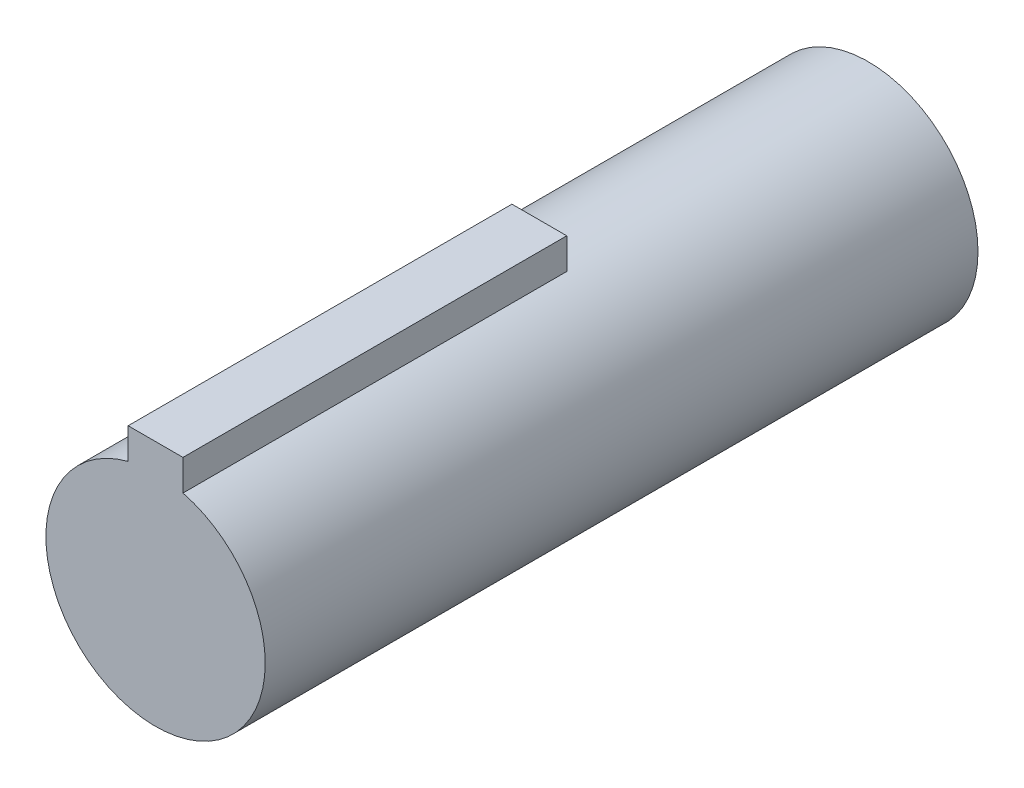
from build123d import *

# Parameters (mm, degrees)
EXTRUDE1_DEPTH      = 10
EXTRUDE1_DEPTH_BACK = 120
CUT_EXTRUDE1_DEPTH  = 60


with BuildPart() as part:
    # Sketch1 → Extrude1 (new, two sides: drawn at the far end of the back side and taken through both)
    with BuildSketch(Plane.XY.offset(-EXTRUDE1_DEPTH_BACK)):
        with BuildLine():
            Line((-5, 25), (-5, 19.364916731))
            ThreePointArc((-5, 19.364916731), (0, -20), (5, 19.364916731))
            Line((5, 19.364916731), (5, 25))
            Line((5, 25), (-5, 25))
        make_face()
    extrude(amount=EXTRUDE1_DEPTH + EXTRUDE1_DEPTH_BACK)

    # Sketch2 → Cut-Extrude1 (cut)
    with BuildSketch(Plane(origin=(0, 0, -120), x_dir=(-1, 0, 0), z_dir=(0, 0, -1))):
        with BuildLine():
            Line((5, 25), (-5, 25))
            Line((-5, 25), (-5, 19.364916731))
            ThreePointArc((-5, 19.364916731), (0, 20), (5, 19.364916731))
            Line((5, 19.364916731), (5, 25))
        make_face()
    extrude(amount=-CUT_EXTRUDE1_DEPTH, mode=Mode.SUBTRACT)


solid = part.part
